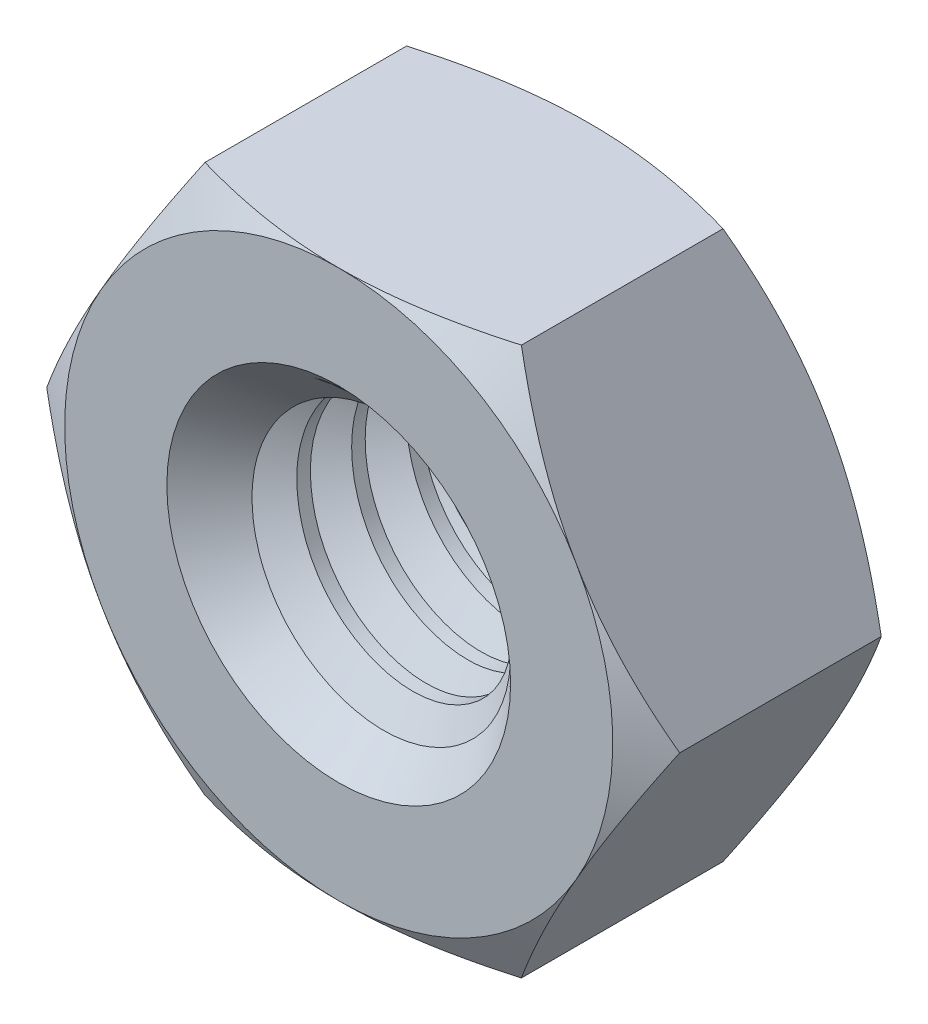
from build123d import *

# Parameters (mm, degrees)
Y_KSEKLIK_EKSTR_ZYON1_DEPTH = 3.2
IZIM2_OUTSIDE_W             = 23.4
IZIM2_OUTSIDE_H             = 22.318
IZIM2_OUTSIDE_R             = 3.5
KES_EKSTR_ZYON1_DEPTH       = 3.2
KES_EKSTR_ZYON1_DRAFT       = -60
IZIM3_OUTSIDE_W             = 23.4
IZIM3_OUTSIDE_H             = 22.318
IZIM3_OUTSIDE_R             = 3.5
KES_EKSTR_ZYON2_DEPTH       = 3.2
KES_EKSTR_ZYON2_DRAFT       = -60
IZIM5_R                     = 1.545
KES_EKSTR_ZYON3_DEPTH       = 3.2
PAH1_SIZE                   = 0.65
KES_S_P_R1_PITCH            = 0.7
KES_S_P_R1_HEIGHT           = 4
KES_S_P_R1_RADIUS           = 1.545


with BuildPart() as part:
    # izim1 → Y_kseklik-Ekstr_zyon1 (new body)
    with BuildSketch(Plane.XY):
        Polygon((4.041451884, 0), (2.020725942, 3.5), (-2.020725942, 3.5), (-4.041451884, 0), (-2.020725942, -3.5), (2.020725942, -3.5), align=None)
    extrude(amount=Y_KSEKLIK_EKSTR_ZYON1_DEPTH)


with BuildPart() as kes_ekstr_zyon1_tool:
    # izim2 outside → Kes-Ekstr_zyon1 (with draft: the straight prism first)
    with BuildSketch(Plane.XY.offset(3.2)):
        Rectangle(IZIM2_OUTSIDE_W, IZIM2_OUTSIDE_H)
        Circle(IZIM2_OUTSIDE_R, mode=Mode.SUBTRACT)
    extrude(amount=-KES_EKSTR_ZYON1_DEPTH)
    # Kes-Ekstr_zyon1: the draft: its side faces are tilted about the plane it starts from
    kes_ekstr_zyon1_sides = [kes_ekstr_zyon1_tool.faces().sort_by_distance(p)[0] for p in [
        (0, -11.159, 1.6),
        (11.7, 0, 1.6),
        (0, 11.159, 1.6),
        (-11.7, 0, 1.6),
        (-3.5, 0, 1.6),
    ]]
    draft(kes_ekstr_zyon1_sides, Plane.XY.offset(3.2), KES_EKSTR_ZYON1_DRAFT)


with BuildPart() as part_1:
    add(part.part)

    # Kes-Ekstr_zyon1: cut by kes_ekstr_zyon1_tool
    add(kes_ekstr_zyon1_tool.part, mode=Mode.SUBTRACT)


with BuildPart() as kes_ekstr_zyon2_tool:
    # izim3 outside → Kes-Ekstr_zyon2 (with draft: the straight prism first)
    with BuildSketch(Plane(origin=(0, 0, 0), x_dir=(-1, 0, 0), z_dir=(0, 0, -1))):
        Rectangle(IZIM3_OUTSIDE_W, IZIM3_OUTSIDE_H)
        Circle(IZIM3_OUTSIDE_R, mode=Mode.SUBTRACT)
    extrude(amount=-KES_EKSTR_ZYON2_DEPTH)
    # Kes-Ekstr_zyon2: the draft: its side faces are tilted about the plane it starts from
    kes_ekstr_zyon2_sides = [kes_ekstr_zyon2_tool.faces().sort_by_distance(p)[0] for p in [
        (0, -11.159, 1.6),
        (-11.7, 0, 1.6),
        (0, 11.159, 1.6),
        (11.7, 0, 1.6),
        (3.5, 0, 1.6),
    ]]
    draft(kes_ekstr_zyon2_sides, Plane(origin=(0, 0, 0), x_dir=(-1, 0, 0), z_dir=(0, 0, -1)), KES_EKSTR_ZYON2_DRAFT)


with BuildPart() as part_2:
    add(part_1.part)

    # Kes-Ekstr_zyon2: cut by kes_ekstr_zyon2_tool
    add(kes_ekstr_zyon2_tool.part, mode=Mode.SUBTRACT)

    # izim5 → Kes-Ekstr_zyon3 (cut)
    with BuildSketch(Plane(origin=(0, 0, 0), x_dir=(-1, 0, 0), z_dir=(0, 0, -1))):
        Circle(IZIM5_R)
    extrude(amount=-KES_EKSTR_ZYON3_DEPTH, mode=Mode.SUBTRACT)

    # Pah1
    pah1_edges = [part_2.edges().sort_by_distance(p)[0] for p in [
        (1.545, 0, 3.2),
        (1.545, 0, 0),
    ]]
    chamfer(pah1_edges, length=PAH1_SIZE)

    # Kes-S_p_r1: sweep along a helix
    with BuildLine() as kes_s_p_r1_path:
        Helix(KES_S_P_R1_PITCH, KES_S_P_R1_HEIGHT, KES_S_P_R1_RADIUS, center=(0, 0, 0), direction=(0, 0, 1))
    # izim7 → Kes-S_p_r1 (sweep, cut)
    with BuildSketch(Plane(origin=(-0.343794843, -1.506263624, 4), x_dir=(0.07011904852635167, -0.016004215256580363, -0.9974102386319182), z_dir=(0.9724030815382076, -0.22194465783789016, 0.07192229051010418))):
        Polygon((0.347294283, 0.146531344), (-0.347294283, 0.146531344), (0, -0.455), align=None)
    sweep(path=kes_s_p_r1_path.line, is_frenet=True, mode=Mode.SUBTRACT)


solid = part_2.part
